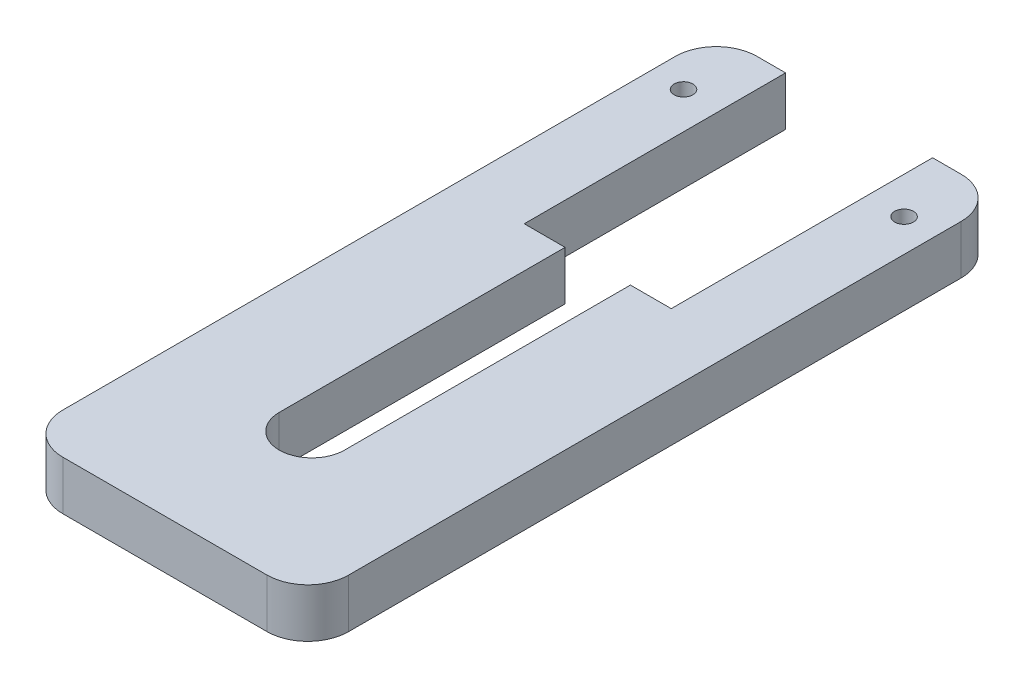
from build123d import *

# Parameters (mm, degrees)
SKIZZE1_R                       = 1.15
AUFSATZ_LINEAR_AUSTRAGEN1_DEPTH = 6


with BuildPart() as part:
    # Skizze1 → Aufsatz-Linear austragen1 (new body)
    with BuildSketch(Plane(origin=(0, 0, 0), x_dir=(1, 0, 0), z_dir=(0, 1, 0))):
        with BuildLine():
            Line((4, 53), (9, 53))
            Line((9, 53), (9, 85))
            Line((9, 85), (12.5, 85))
            ThreePointArc((12.5, 85), (16.035533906, 83.535533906), (17.5, 80))
            Line((17.5, 80), (17.5, 5))
            ThreePointArc((17.5, 5), (16.035533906, 1.464466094), (12.5, 0))
            Line((12.5, 0), (-12.5, 0))
            ThreePointArc((-12.5, 0), (-16.035533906, 1.464466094), (-17.5, 5))
            Line((-17.5, 5), (-17.5, 80))
            ThreePointArc((-17.5, 80), (-16.035533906, 83.535533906), (-12.5, 85))
            Line((-12.5, 85), (-9, 85))
            Line((-9, 85), (-9, 53))
            Line((-9, 53), (-4, 53))
            Line((-4, 53), (-4, 18))
            ThreePointArc((-4, 18), (0, 14), (4, 18))
            Line((4, 18), (4, 53))
        make_face()
        with Locations(Location((-13.5, 77, 0), (0, 0, 270))):
            Circle(SKIZZE1_R, mode=Mode.SUBTRACT)
        with Locations(Location((13.5, 77, 0), (0, 0, 90))):
            Circle(SKIZZE1_R, mode=Mode.SUBTRACT)
    extrude(amount=AUFSATZ_LINEAR_AUSTRAGEN1_DEPTH)


solid = part.part
